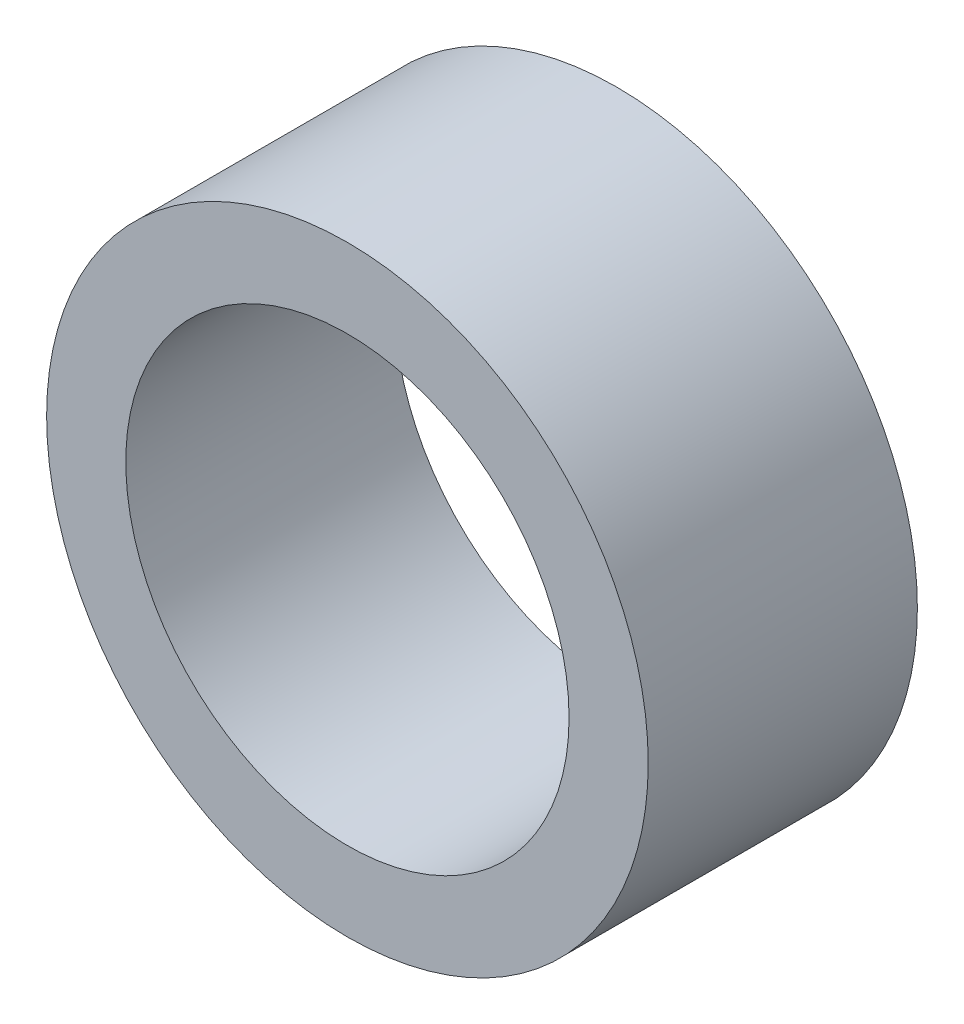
from build123d import *

# Parameters (mm, degrees)
SKETCH1_R      = 19
SKETCH1_R_2    = 14
EXTRUDE1_DEPTH = 17


with BuildPart() as part:
    # Sketch1 → Extrude1 (new body)
    with BuildSketch(Plane.XY):
        Circle(SKETCH1_R)
        Circle(SKETCH1_R_2, mode=Mode.SUBTRACT)
    extrude(amount=EXTRUDE1_DEPTH)


solid = part.part
